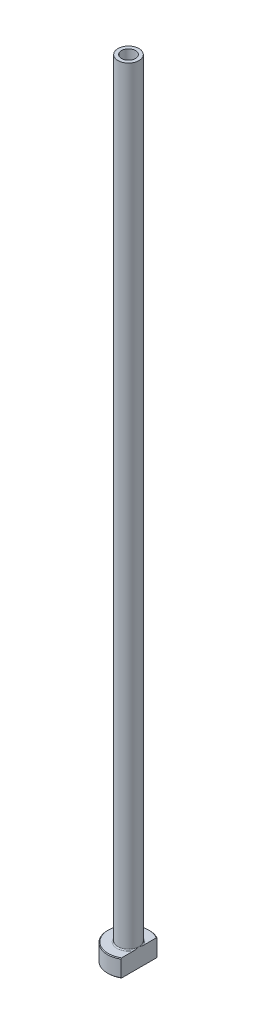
ISO-10303-21;
HEADER;
FILE_DESCRIPTION(('STEP AP214'),'2;1');
FILE_NAME('part.step','',(''),(''),'','','');
FILE_SCHEMA(('AUTOMOTIVE_DESIGN { 1 0 10303 214 1 1 1 1 }'));
ENDSEC;
DATA;
#1=APPLICATION_CONTEXT('core data for automotive mechanical design processes');
#2=APPLICATION_PROTOCOL_DEFINITION('international standard','automotive_design',2000,#1);
#3=PRODUCT_CONTEXT('',#1,'mechanical');
#4=PRODUCT('Part','Part','',(#3));
#5=PRODUCT_RELATED_PRODUCT_CATEGORY('part','',(#4));
#6=PRODUCT_DEFINITION_FORMATION('','',#4);
#7=PRODUCT_DEFINITION_CONTEXT('part definition',#1,'design');
#8=PRODUCT_DEFINITION('design','',#6,#7);
#9=PRODUCT_DEFINITION_SHAPE('','',#8);
#10=(LENGTH_UNIT() NAMED_UNIT(*) SI_UNIT(.MILLI.,.METRE.));
#11=(NAMED_UNIT(*) PLANE_ANGLE_UNIT() SI_UNIT($,.RADIAN.));
#12=(NAMED_UNIT(*) SI_UNIT($,.STERADIAN.) SOLID_ANGLE_UNIT());
#13=UNCERTAINTY_MEASURE_WITH_UNIT(LENGTH_MEASURE(1.E-05),#10,'distance_accuracy_value','');
#14=(GEOMETRIC_REPRESENTATION_CONTEXT(3) GLOBAL_UNCERTAINTY_ASSIGNED_CONTEXT((#13)) GLOBAL_UNIT_ASSIGNED_CONTEXT((#10,
#11,#12)) REPRESENTATION_CONTEXT('',''));
#15=CARTESIAN_POINT('',(0.,0.,0.));
#16=DIRECTION('',(0.,0.,1.));
#17=DIRECTION('',(1.,0.,0.));
#18=AXIS2_PLACEMENT_3D('',#15,#16,#17);
#19=CARTESIAN_POINT('',(0.,92.1876809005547,0.));
#20=DIRECTION('',(0.,1.,0.));
#21=DIRECTION('',(0.,0.,1.));
#22=AXIS2_PLACEMENT_3D('',#19,#20,#21);
#23=CYLINDRICAL_SURFACE('',#22,2.00000000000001);
#24=CARTESIAN_POINT('',(0.,225.,0.));
#25=DIRECTION('',(0.,1.,0.));
#26=DIRECTION('',(0.,0.,1.));
#27=AXIS2_PLACEMENT_3D('',#24,#25,#26);
#28=CIRCLE('',#27,2.00000000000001);
#29=CARTESIAN_POINT('',(0.,225.,2.00000000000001));
#30=VERTEX_POINT('',#29);
#31=EDGE_CURVE('E167',#30,#30,#28,.T.);
#32=ORIENTED_EDGE('',*,*,#31,.T.);
#33=EDGE_LOOP('',(#32));
#34=FACE_BOUND('',#33,.T.);
#35=CARTESIAN_POINT('',(0.,180.,0.));
#36=DIRECTION('',(0.,1.,0.));
#37=DIRECTION('',(0.,0.,1.));
#38=AXIS2_PLACEMENT_3D('',#35,#36,#37);
#39=CIRCLE('',#38,2.00000000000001);
#40=CARTESIAN_POINT('',(0.,180.,2.00000000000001));
#41=VERTEX_POINT('',#40);
#42=EDGE_CURVE('E170',#41,#41,#39,.T.);
#43=ORIENTED_EDGE('',*,*,#42,.F.);
#44=EDGE_LOOP('',(#43));
#45=FACE_BOUND('',#44,.T.);
#46=ADVANCED_FACE('F32',(#34,#45),#23,.F.);
#47=CARTESIAN_POINT('',(-2.00000000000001,225.,0.));
#48=DIRECTION('',(0.,1.,0.));
#49=DIRECTION('',(0.,0.,1.));
#50=AXIS2_PLACEMENT_3D('',#47,#48,#49);
#51=PLANE('',#50);
#52=CARTESIAN_POINT('',(0.,225.,0.));
#53=DIRECTION('',(0.,1.,0.));
#54=DIRECTION('',(0.,0.,1.));
#55=AXIS2_PLACEMENT_3D('',#52,#53,#54);
#56=CIRCLE('',#55,3.00000000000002);
#57=CARTESIAN_POINT('',(0.,225.,3.00000000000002));
#58=VERTEX_POINT('',#57);
#59=EDGE_CURVE('E174',#58,#58,#56,.T.);
#60=ORIENTED_EDGE('',*,*,#59,.T.);
#61=EDGE_LOOP('',(#60));
#62=FACE_BOUND('',#61,.T.);
#63=ORIENTED_EDGE('',*,*,#31,.F.);
#64=EDGE_LOOP('',(#63));
#65=FACE_BOUND('',#64,.T.);
#66=ADVANCED_FACE('F157',(#62,#65),#51,.T.);
#67=CARTESIAN_POINT('',(0.,92.1876809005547,0.));
#68=DIRECTION('',(0.,1.,0.));
#69=DIRECTION('',(0.,0.,1.));
#70=AXIS2_PLACEMENT_3D('',#67,#68,#69);
#71=CYLINDRICAL_SURFACE('',#70,3.);
#72=CARTESIAN_POINT('',(0.,5.3,0.));
#73=DIRECTION('',(0.,1.,0.));
#74=DIRECTION('',(0.,0.,1.));
#75=AXIS2_PLACEMENT_3D('',#72,#73,#74);
#76=CIRCLE('',#75,3.);
#77=CARTESIAN_POINT('',(3.,5.3,0.));
#78=VERTEX_POINT('',#77);
#79=EDGE_CURVE('E180',#78,#78,#76,.T.);
#80=ORIENTED_EDGE('',*,*,#79,.T.);
#81=EDGE_LOOP('',(#80));
#82=FACE_BOUND('',#81,.T.);
#83=ORIENTED_EDGE('',*,*,#59,.F.);
#84=EDGE_LOOP('',(#83));
#85=FACE_BOUND('',#84,.T.);
#86=ADVANCED_FACE('F162',(#82,#85),#71,.T.);
#87=CARTESIAN_POINT('',(-2.99999999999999,5.,0.));
#88=DIRECTION('',(0.,1.,0.));
#89=DIRECTION('',(0.,0.,1.));
#90=AXIS2_PLACEMENT_3D('',#87,#88,#89);
#91=PLANE('',#90);
#92=DIRECTION('',(0.,0.,1.));
#93=VECTOR('',#92,1.);
#94=CARTESIAN_POINT('',(2.99999999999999,5.,0.));
#95=LINE('',#94,#93);
#96=CARTESIAN_POINT('',(3.,5.,-4.96386945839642));
#97=VERTEX_POINT('',#96);
#98=CARTESIAN_POINT('',(2.99999999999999,5.,-1.37477270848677));
#99=VERTEX_POINT('',#98);
#100=EDGE_CURVE('E54',#97,#99,#95,.T.);
#101=ORIENTED_EDGE('',*,*,#100,.F.);
#102=CARTESIAN_POINT('',(0.,5.,0.));
#103=DIRECTION('',(0.,1.,0.));
#104=DIRECTION('',(0.,0.,1.));
#105=AXIS2_PLACEMENT_3D('',#102,#103,#104);
#106=CIRCLE('',#105,5.80000000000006);
#107=CARTESIAN_POINT('',(2.99999999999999,5.,4.96386945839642));
#108=VERTEX_POINT('',#107);
#109=EDGE_CURVE('E186',#97,#108,#106,.T.);
#110=ORIENTED_EDGE('',*,*,#109,.T.);
#111=CARTESIAN_POINT('',(2.99999999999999,5.,1.37477270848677));
#112=VERTEX_POINT('',#111);
#113=EDGE_CURVE('E134',#112,#108,#95,.T.);
#114=ORIENTED_EDGE('',*,*,#113,.F.);
#115=CARTESIAN_POINT('',(0.,5.,0.));
#116=DIRECTION('',(0.,1.,0.));
#117=DIRECTION('',(0.,0.,1.));
#118=AXIS2_PLACEMENT_3D('',#115,#116,#117);
#119=CIRCLE('',#118,3.3);
#120=EDGE_CURVE('E183',#112,#99,#119,.F.);
#121=ORIENTED_EDGE('',*,*,#120,.T.);
#122=EDGE_LOOP('',(#101,#110,#114,#121));
#123=FACE_BOUND('',#122,.T.);
#124=ADVANCED_FACE('F197',(#123),#91,.T.);
#125=CARTESIAN_POINT('',(0.,92.1876809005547,0.));
#126=DIRECTION('',(0.,1.,0.));
#127=DIRECTION('',(0.,0.,1.));
#128=AXIS2_PLACEMENT_3D('',#125,#126,#127);
#129=CYLINDRICAL_SURFACE('',#128,5.99999999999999);
#130=DIRECTION('',(0.,-1.,0.));
#131=VECTOR('',#130,1.);
#132=CARTESIAN_POINT('',(2.99999999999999,225.,5.19615242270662));
#133=LINE('',#132,#131);
#134=CARTESIAN_POINT('',(2.99999999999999,4.80000000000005,5.19615242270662));
#135=VERTEX_POINT('',#134);
#136=CARTESIAN_POINT('',(2.99999999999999,0.199999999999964,5.19615242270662));
#137=VERTEX_POINT('',#136);
#138=EDGE_CURVE('E82',#135,#137,#133,.T.);
#139=ORIENTED_EDGE('',*,*,#138,.F.);
#140=CARTESIAN_POINT('',(0.,4.80000000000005,0.));
#141=DIRECTION('',(0.,1.,0.));
#142=DIRECTION('',(0.,0.,1.));
#143=AXIS2_PLACEMENT_3D('',#140,#141,#142);
#144=CIRCLE('',#143,5.99999999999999);
#145=CARTESIAN_POINT('',(3.,4.80000000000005,-5.19615242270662));
#146=VERTEX_POINT('',#145);
#147=EDGE_CURVE('E95',#135,#146,#144,.F.);
#148=ORIENTED_EDGE('',*,*,#147,.T.);
#149=DIRECTION('',(0.,-1.,0.));
#150=VECTOR('',#149,1.);
#151=CARTESIAN_POINT('',(3.,225.,-5.19615242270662));
#152=LINE('',#151,#150);
#153=CARTESIAN_POINT('',(3.,0.199999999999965,-5.19615242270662));
#154=VERTEX_POINT('',#153);
#155=EDGE_CURVE('E192',#146,#154,#152,.T.);
#156=ORIENTED_EDGE('',*,*,#155,.T.);
#157=CARTESIAN_POINT('',(0.,0.199999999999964,0.));
#158=DIRECTION('',(0.,-1.,0.));
#159=DIRECTION('',(0.,0.,-1.));
#160=AXIS2_PLACEMENT_3D('',#157,#158,#159);
#161=CIRCLE('',#160,5.99999999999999);
#162=EDGE_CURVE('E98',#154,#137,#161,.F.);
#163=ORIENTED_EDGE('',*,*,#162,.T.);
#164=EDGE_LOOP('',(#139,#148,#156,#163));
#165=FACE_BOUND('',#164,.T.);
#166=ADVANCED_FACE('F190',(#165),#129,.T.);
#167=CARTESIAN_POINT('',(-5.99999999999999,0.,0.));
#168=DIRECTION('',(0.,-1.,0.));
#169=DIRECTION('',(0.,0.,-1.));
#170=AXIS2_PLACEMENT_3D('',#167,#168,#169);
#171=PLANE('',#170);
#172=CARTESIAN_POINT('',(0.,0.,0.));
#173=DIRECTION('',(0.,-1.,0.));
#174=DIRECTION('',(0.,0.,-1.));
#175=AXIS2_PLACEMENT_3D('',#172,#173,#174);
#176=CIRCLE('',#175,2.74999999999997);
#177=CARTESIAN_POINT('',(0.,0.,-2.74999999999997));
#178=VERTEX_POINT('',#177);
#179=EDGE_CURVE('E40',#178,#178,#176,.F.);
#180=ORIENTED_EDGE('',*,*,#179,.T.);
#181=EDGE_LOOP('',(#180));
#182=FACE_BOUND('',#181,.T.);
#183=DIRECTION('',(0.,0.,-1.));
#184=VECTOR('',#183,1.);
#185=CARTESIAN_POINT('',(2.99999999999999,0.,5.19615242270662));
#186=LINE('',#185,#184);
#187=CARTESIAN_POINT('',(2.99999999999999,0.,4.96386945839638));
#188=VERTEX_POINT('',#187);
#189=CARTESIAN_POINT('',(3.,0.,-4.96386945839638));
#190=VERTEX_POINT('',#189);
#191=EDGE_CURVE('E47',#188,#190,#186,.T.);
#192=ORIENTED_EDGE('',*,*,#191,.F.);
#193=CARTESIAN_POINT('',(0.,0.,0.));
#194=DIRECTION('',(0.,-1.,0.));
#195=DIRECTION('',(0.,0.,-1.));
#196=AXIS2_PLACEMENT_3D('',#193,#194,#195);
#197=CIRCLE('',#196,5.80000000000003);
#198=EDGE_CURVE('E92',#188,#190,#197,.T.);
#199=ORIENTED_EDGE('',*,*,#198,.T.);
#200=EDGE_LOOP('',(#192,#199));
#201=FACE_BOUND('',#200,.T.);
#202=ADVANCED_FACE('F91',(#182,#201),#171,.T.);
#203=CARTESIAN_POINT('',(0.,92.1876809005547,0.));
#204=DIRECTION('',(0.,1.,0.));
#205=DIRECTION('',(0.,0.,1.));
#206=AXIS2_PLACEMENT_3D('',#203,#204,#205);
#207=CYLINDRICAL_SURFACE('',#206,2.25);
#208=CARTESIAN_POINT('',(0.,0.5,0.));
#209=DIRECTION('',(0.,-1.,0.));
#210=DIRECTION('',(0.,0.,-1.));
#211=AXIS2_PLACEMENT_3D('',#208,#209,#210);
#212=CIRCLE('',#211,2.25);
#213=CARTESIAN_POINT('',(0.,0.5,-2.25));
#214=VERTEX_POINT('',#213);
#215=EDGE_CURVE('E11',#214,#214,#212,.T.);
#216=ORIENTED_EDGE('',*,*,#215,.T.);
#217=EDGE_LOOP('',(#216));
#218=FACE_BOUND('',#217,.T.);
#219=CARTESIAN_POINT('',(0.,168.,0.));
#220=DIRECTION('',(0.,1.,0.));
#221=DIRECTION('',(0.,0.,1.));
#222=AXIS2_PLACEMENT_3D('',#219,#220,#221);
#223=CIRCLE('',#222,2.25000000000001);
#224=CARTESIAN_POINT('',(0.,168.,2.25000000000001));
#225=VERTEX_POINT('',#224);
#226=EDGE_CURVE('E172',#225,#225,#223,.T.);
#227=ORIENTED_EDGE('',*,*,#226,.T.);
#228=EDGE_LOOP('',(#227));
#229=FACE_BOUND('',#228,.T.);
#230=ADVANCED_FACE('F215',(#218,#229),#207,.F.);
#231=CARTESIAN_POINT('',(0.,168.,0.));
#232=DIRECTION('',(0.,-1.,0.));
#233=DIRECTION('',(0.,0.,-1.));
#234=AXIS2_PLACEMENT_3D('',#231,#232,#233);
#235=CONICAL_SURFACE('',#234,2.25000000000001,0.0208303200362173);
#236=ORIENTED_EDGE('',*,*,#42,.T.);
#237=EDGE_LOOP('',(#236));
#238=FACE_BOUND('',#237,.T.);
#239=ORIENTED_EDGE('',*,*,#226,.F.);
#240=EDGE_LOOP('',(#239));
#241=FACE_BOUND('',#240,.T.);
#242=ADVANCED_FACE('F111',(#238,#241),#235,.F.);
#243=CARTESIAN_POINT('',(0.,5.3,0.));
#244=DIRECTION('',(0.,1.,0.));
#245=DIRECTION('',(0.,0.,1.));
#246=AXIS2_PLACEMENT_3D('',#243,#244,#245);
#247=TOROIDAL_SURFACE('',#246,3.3,0.3);
#248=ORIENTED_EDGE('',*,*,#120,.F.);
#249=CARTESIAN_POINT('',(3.,5.3,0.));
#250=CARTESIAN_POINT('',(3.,5.3000006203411,-1.12611076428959E-10));
#251=CARTESIAN_POINT('',(3.,5.30000124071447,1.79706863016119E-07));
#252=CARTESIAN_POINT('',(3.,5.30000241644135,7.12597681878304E-07));
#253=CARTESIAN_POINT('',(3.,5.30000296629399,1.07470925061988E-06));
#254=CARTESIAN_POINT('',(3.,5.30000408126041,1.93940847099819E-06));
#255=CARTESIAN_POINT('',(3.,5.3000046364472,2.45488642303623E-06));
#256=CARTESIAN_POINT('',(3.,5.30000565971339,3.54465580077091E-06));
#257=CARTESIAN_POINT('',(3.,5.30000612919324,4.11770724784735E-06));
#258=CARTESIAN_POINT('',(3.,5.30000778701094,6.25396528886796E-06));
#259=CARTESIAN_POINT('',(3.,5.30000888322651,7.89070948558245E-06));
#260=CARTESIAN_POINT('',(3.,5.3000107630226,1.11998064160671E-05));
#261=CARTESIAN_POINT('',(3.,5.30001156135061,1.28642122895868E-05));
#262=CARTESIAN_POINT('',(3.,5.30001474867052,1.96537189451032E-05));
#263=CARTESIAN_POINT('',(3.,5.30001702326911,2.48380262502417E-05));
#264=CARTESIAN_POINT('',(3.,5.30002052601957,3.48178510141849E-05));
#265=CARTESIAN_POINT('',(3.,5.30002184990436,3.95800651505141E-05));
#266=CARTESIAN_POINT('',(3.,5.30003122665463,7.41814419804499E-05));
#267=CARTESIAN_POINT('',(3.,5.30003808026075,0.000104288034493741));
#268=CARTESIAN_POINT('',(2.99999999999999,5.30006804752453,0.000222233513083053));
#269=CARTESIAN_POINT('',(2.99999999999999,5.30009687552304,0.000308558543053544));
#270=CARTESIAN_POINT('',(3.,5.30020809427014,0.000648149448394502));
#271=CARTESIAN_POINT('',(3.,5.30028657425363,0.000902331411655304));
#272=CARTESIAN_POINT('',(2.99999999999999,5.30059876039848,0.00190491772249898));
#273=CARTESIAN_POINT('',(2.99999999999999,5.30083723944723,0.00265218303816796));
#274=CARTESIAN_POINT('',(3.,5.30182192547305,0.00574694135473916));
#275=CARTESIAN_POINT('',(3.,5.3025622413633,0.00809584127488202));
#276=CARTESIAN_POINT('',(2.99999999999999,5.31160267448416,0.0367678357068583));
#277=CARTESIAN_POINT('',(2.99999999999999,5.31993817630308,0.0630827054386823));
#278=CARTESIAN_POINT('',(3.,5.33621504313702,0.114704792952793));
#279=CARTESIAN_POINT('',(3.,5.34415908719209,0.140011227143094));
#280=CARTESIAN_POINT('',(2.99999999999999,5.36094382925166,0.193774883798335));
#281=CARTESIAN_POINT('',(3.,5.3697741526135,0.222235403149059));
#282=CARTESIAN_POINT('',(3.,5.38736474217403,0.279512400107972));
#283=CARTESIAN_POINT('',(3.,5.396123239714,0.308329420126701));
#284=CARTESIAN_POINT('',(3.,5.41726575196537,0.378880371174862));
#285=CARTESIAN_POINT('',(3.,5.4295272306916,0.420651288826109));
#286=CARTESIAN_POINT('',(3.,5.45309597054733,0.503357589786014));
#287=CARTESIAN_POINT('',(3.,5.46441924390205,0.544288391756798));
#288=CARTESIAN_POINT('',(3.,5.48778169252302,0.632156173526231));
#289=CARTESIAN_POINT('',(3.,5.49969678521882,0.67912648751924));
#290=CARTESIAN_POINT('',(3.,5.52221484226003,0.773740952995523));
#291=CARTESIAN_POINT('',(3.,5.53280772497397,0.82138752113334));
#292=CARTESIAN_POINT('',(3.,5.55291503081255,0.920589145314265));
#293=CARTESIAN_POINT('',(3.,5.56229188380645,0.972172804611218));
#294=CARTESIAN_POINT('',(3.,5.57838694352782,1.0757483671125));
#295=CARTESIAN_POINT('',(3.,5.585105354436,1.12774023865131));
#296=CARTESIAN_POINT('',(3.,5.59681427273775,1.24924411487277));
#297=CARTESIAN_POINT('',(3.,5.60051317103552,1.31890364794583));
#298=CARTESIAN_POINT('',(3.,5.59966579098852,1.42270835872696));
#299=CARTESIAN_POINT('',(3.,5.59835823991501,1.45688093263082));
#300=CARTESIAN_POINT('',(3.,5.59322745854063,1.52502533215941));
#301=CARTESIAN_POINT('',(3.,5.58940645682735,1.55899730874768));
#302=CARTESIAN_POINT('',(3.,5.57976146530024,1.6194781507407));
#303=CARTESIAN_POINT('',(3.,5.57451506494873,1.64607760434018));
#304=CARTESIAN_POINT('',(3.,5.56161153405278,1.69883648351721));
#305=CARTESIAN_POINT('',(3.,5.55394338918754,1.7249933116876));
#306=CARTESIAN_POINT('',(3.,5.53555176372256,1.77650913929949));
#307=CARTESIAN_POINT('',(3.,5.52480031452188,1.80185836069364));
#308=CARTESIAN_POINT('',(3.,5.49948027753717,1.85054545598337));
#309=CARTESIAN_POINT('',(3.,5.48493141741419,1.87389291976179));
#310=CARTESIAN_POINT('',(3.,5.45992470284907,1.90552135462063));
#311=CARTESIAN_POINT('',(3.,5.45133318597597,1.91527363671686));
#312=CARTESIAN_POINT('',(3.,5.43294163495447,1.93360072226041));
#313=CARTESIAN_POINT('',(3.,5.42314083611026,1.94217477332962));
#314=CARTESIAN_POINT('',(3.,5.40215892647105,1.95778354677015));
#315=CARTESIAN_POINT('',(3.,5.39096156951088,1.96479687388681));
#316=CARTESIAN_POINT('',(3.,5.36742144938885,1.97652218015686));
#317=CARTESIAN_POINT('',(3.,5.35508207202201,1.98124071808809));
#318=CARTESIAN_POINT('',(3.,5.33320117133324,1.98690185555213));
#319=CARTESIAN_POINT('',(3.,5.32383559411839,1.98852953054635));
#320=CARTESIAN_POINT('',(3.,5.30496375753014,1.99016898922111));
#321=CARTESIAN_POINT('',(3.,5.29545756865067,1.99018155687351));
#322=CARTESIAN_POINT('',(3.,5.27659318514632,1.9885897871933));
#323=CARTESIAN_POINT('',(3.,5.26723486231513,1.98698693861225));
#324=CARTESIAN_POINT('',(3.,5.2488995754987,1.9822972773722));
#325=CARTESIAN_POINT('',(3.,5.23992286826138,1.97920948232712));
#326=CARTESIAN_POINT('',(3.,5.21981293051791,1.97059641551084));
#327=CARTESIAN_POINT('',(3.,5.20887713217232,1.96461176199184));
#328=CARTESIAN_POINT('',(3.,5.18811536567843,1.95095727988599));
#329=CARTESIAN_POINT('',(3.,5.17829177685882,1.94328393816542));
#330=CARTESIAN_POINT('',(3.,5.15512177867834,1.92254223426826));
#331=CARTESIAN_POINT('',(3.,5.14247568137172,1.90869680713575));
#332=CARTESIAN_POINT('',(3.,5.1194459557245,1.87927587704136));
#333=CARTESIAN_POINT('',(3.,5.10906527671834,1.86369815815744));
#334=CARTESIAN_POINT('',(3.,5.08309609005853,1.81927355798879));
#335=CARTESIAN_POINT('',(3.,5.06948546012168,1.78928084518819));
#336=CARTESIAN_POINT('',(3.,5.04658664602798,1.72751962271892));
#337=CARTESIAN_POINT('',(3.,5.03733582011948,1.69573828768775));
#338=CARTESIAN_POINT('',(3.,5.0221431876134,1.63079918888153));
#339=CARTESIAN_POINT('',(3.,5.01626537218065,1.59762686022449));
#340=CARTESIAN_POINT('',(3.,5.00734002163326,1.53086029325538));
#341=CARTESIAN_POINT('',(3.,5.00429797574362,1.49726536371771));
#342=CARTESIAN_POINT('',(3.,5.00059037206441,1.43100872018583));
#343=CARTESIAN_POINT('',(3.,4.99985343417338,1.39835069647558));
#344=CARTESIAN_POINT('',(3.,5.00019322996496,1.33318312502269));
#345=CARTESIAN_POINT('',(3.,5.00126261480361,1.30067351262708));
#346=CARTESIAN_POINT('',(3.,5.00569854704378,1.22190465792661));
#347=CARTESIAN_POINT('',(3.,5.00984986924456,1.17569031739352));
#348=CARTESIAN_POINT('',(3.,5.02060876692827,1.08357061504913));
#349=CARTESIAN_POINT('',(3.,5.02721586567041,1.03766519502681));
#350=CARTESIAN_POINT('',(3.,5.04258096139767,0.945130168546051));
#351=CARTESIAN_POINT('',(3.,5.05138514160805,0.898508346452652));
#352=CARTESIAN_POINT('',(3.,5.07066869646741,0.805496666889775));
#353=CARTESIAN_POINT('',(3.,5.08115218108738,0.759107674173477));
#354=CARTESIAN_POINT('',(3.,5.10738921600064,0.650207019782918));
#355=CARTESIAN_POINT('',(3.,5.12369110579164,0.587828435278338));
#356=CARTESIAN_POINT('',(3.,5.15777680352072,0.46421277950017));
#357=CARTESIAN_POINT('',(3.,5.17554263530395,0.402970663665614));
#358=CARTESIAN_POINT('',(3.,5.2100672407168,0.287596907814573));
#359=CARTESIAN_POINT('',(3.,5.22671796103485,0.233432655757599));
#360=CARTESIAN_POINT('',(3.,5.25241226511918,0.150940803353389));
#361=CARTESIAN_POINT('',(3.,5.2613106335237,0.122567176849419));
#362=CARTESIAN_POINT('',(3.,5.27905176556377,0.0662804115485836));
#363=CARTESIAN_POINT('',(2.99999999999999,5.28789327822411,0.0383669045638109));
#364=CARTESIAN_POINT('',(3.,5.29743877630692,0.00809257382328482));
#365=CARTESIAN_POINT('',(3.,5.29818012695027,0.00574041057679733));
#366=CARTESIAN_POINT('',(3.,5.29916506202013,0.00264489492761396));
#367=CARTESIAN_POINT('',(3.,5.29940274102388,0.00190013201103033));
#368=CARTESIAN_POINT('',(3.,5.29971394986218,0.000900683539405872));
#369=CARTESIAN_POINT('',(3.,5.29979223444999,0.00064713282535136));
#370=CARTESIAN_POINT('',(3.,5.29990321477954,0.000308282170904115));
#371=CARTESIAN_POINT('',(3.,5.29993200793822,0.000222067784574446));
#372=CARTESIAN_POINT('',(3.,5.29996194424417,0.000104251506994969));
#373=CARTESIAN_POINT('',(3.,5.29996879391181,7.41614257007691E-05));
#374=CARTESIAN_POINT('',(3.,5.29997816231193,3.95766714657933E-05));
#375=CARTESIAN_POINT('',(3.,5.29997948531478,3.48154674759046E-05));
#376=CARTESIAN_POINT('',(3.,5.29998298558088,2.48376286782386E-05));
#377=CARTESIAN_POINT('',(3.,5.29998525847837,1.96542458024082E-05));
#378=CARTESIAN_POINT('',(3.,5.29998844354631,1.28656657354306E-05));
#379=CARTESIAN_POINT('',(3.,5.29998924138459,1.1201335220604E-05));
#380=CARTESIAN_POINT('',(3.,5.29999112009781,7.89230050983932E-06));
#381=CARTESIAN_POINT('',(3.,5.29999221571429,6.25553551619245E-06));
#382=CARTESIAN_POINT('',(3.,5.29999387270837,4.11914378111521E-06));
#383=CARTESIAN_POINT('',(3.,5.29999434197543,3.54603105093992E-06));
#384=CARTESIAN_POINT('',(3.,5.29999536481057,2.45610077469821E-06));
#385=CARTESIAN_POINT('',(3.,5.29999591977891,1.94052235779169E-06));
#386=CARTESIAN_POINT('',(3.,5.29999703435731,1.07558328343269E-06));
#387=CARTESIAN_POINT('',(3.,5.29999758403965,7.13339485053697E-07));
#388=CARTESIAN_POINT('',(3.,5.29999875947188,1.80121956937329E-07));
#389=CARTESIAN_POINT('',(3.,5.2999993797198,1.12600521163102E-10));
#390=CARTESIAN_POINT('',(3.,5.3,0.));
#391=B_SPLINE_CURVE_WITH_KNOTS('',3,(#249,#250,#251,#252,#253,#254,#255,#256,#257,#258,#259,
#260,#261,#262,#263,#264,#265,#266,#267,#268,#269,#270,#271,#272,#273,#274,#275,#276,#277,#278,
#279,#280,#281,#282,#283,#284,#285,#286,#287,#288,#289,#290,#291,#292,#293,#294,#295,#296,#297,
#298,#299,#300,#301,#302,#303,#304,#305,#306,#307,#308,#309,#310,#311,#312,#313,#314,#315,#316,
#317,#318,#319,#320,#321,#322,#323,#324,#325,#326,#327,#328,#329,#330,#331,#332,#333,#334,#335,
#336,#337,#338,#339,#340,#341,#342,#343,#344,#345,#346,#347,#348,#349,#350,#351,#352,#353,#354,
#355,#356,#357,#358,#359,#360,#361,#362,#363,#364,#365,#366,#367,#368,#369,#370,#371,#372,#373,
#374,#375,#376,#377,#378,#379,#380,#381,#382,#383,#384,#385,#386,#387,#388,#389,#390),
.UNSPECIFIED.,.T.,.F.,(4,2,2,2,2,2,2,2,2,2,2,2,2,2,2,2,2,2,2,2,2,2,2,2,2,2,2,2,2,2,2,2,2,2,2,2,
2,2,2,2,2,2,2,2,2,2,2,2,2,2,2,2,2,2,2,2,2,2,2,2,2,2,2,2,2,2,2,2,2,2,4),(0.,1.86513812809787E-06,
3.83353150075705E-06,6.09513108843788E-06,8.31560377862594E-06,1.42000679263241E-05,
1.9733547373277E-05,3.66769838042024E-05,5.14858282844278E-05,0.000144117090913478,
0.000416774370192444,0.00121521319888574,0.00356794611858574,0.0109568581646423,
0.093763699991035,0.173336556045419,0.262732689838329,0.353088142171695,0.48368402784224,
0.611082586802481,0.756439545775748,0.902844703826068,1.06007042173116,1.21728406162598,
1.42611662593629,1.52864191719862,1.63107642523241,1.71232857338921,1.7939557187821,
1.87634808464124,1.95832065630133,1.99722769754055,2.03615946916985,2.07559591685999,
2.11491897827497,2.14330913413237,2.17168550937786,2.20003575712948,2.22840478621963,
2.26559554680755,2.30286442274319,2.35880214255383,2.41481225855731,2.51307007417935,
2.61215518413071,2.71306273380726,2.81416520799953,2.91210427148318,3.00964583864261,
3.14875779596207,3.28784276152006,3.43014232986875,3.57279564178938,3.76617940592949,
3.9574672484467,4.12746077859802,4.21667041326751,4.30450746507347,4.31190664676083,
4.31425150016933,4.31504795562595,4.31532026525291,4.3154128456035,4.3154276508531,
4.31544458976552,4.31545012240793,4.31545600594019,4.31545822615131,4.31546048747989,
4.31546245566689,4.3154643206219),.UNSPECIFIED.);
#392=EDGE_CURVE('E126',#112,#78,#391,.T.);
#393=ORIENTED_EDGE('',*,*,#392,.T.);
#394=ORIENTED_EDGE('',*,*,#79,.F.);
#395=CARTESIAN_POINT('',(3.,5.3,0.));
#396=CARTESIAN_POINT('',(3.,5.2999993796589,1.12611568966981E-10));
#397=CARTESIAN_POINT('',(3.,5.29999875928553,-1.79706862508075E-07));
#398=CARTESIAN_POINT('',(3.,5.29999758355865,-7.12597681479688E-07));
#399=CARTESIAN_POINT('',(3.,5.29999703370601,-1.07470925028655E-06));
#400=CARTESIAN_POINT('',(3.,5.29999591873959,-1.93940847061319E-06));
#401=CARTESIAN_POINT('',(3.,5.2999953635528,-2.45488642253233E-06));
#402=CARTESIAN_POINT('',(3.,5.29999434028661,-3.54465580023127E-06));
#403=CARTESIAN_POINT('',(3.,5.29999387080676,-4.11770724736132E-06));
#404=CARTESIAN_POINT('',(3.,5.29999221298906,-6.25396528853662E-06));
#405=CARTESIAN_POINT('',(3.,5.29999111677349,-7.8907094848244E-06));
#406=CARTESIAN_POINT('',(3.,5.29998923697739,-1.11998064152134E-05));
#407=CARTESIAN_POINT('',(3.,5.29998843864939,-1.28642122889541E-05));
#408=CARTESIAN_POINT('',(3.,5.29998525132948,-1.9653718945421E-05));
#409=CARTESIAN_POINT('',(3.,5.29998297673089,-2.48380262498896E-05));
#410=CARTESIAN_POINT('',(3.,5.29997947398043,-3.48178510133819E-05));
#411=CARTESIAN_POINT('',(3.,5.29997815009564,-3.95800651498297E-05));
#412=CARTESIAN_POINT('',(3.,5.29996877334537,-7.41814419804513E-05));
#413=CARTESIAN_POINT('',(3.,5.29996191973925,-0.000104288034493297));
#414=CARTESIAN_POINT('',(3.,5.29993195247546,-0.000222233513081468));
#415=CARTESIAN_POINT('',(3.,5.29990312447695,-0.000308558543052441));
#416=CARTESIAN_POINT('',(3.,5.29979190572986,-0.000648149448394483));
#417=CARTESIAN_POINT('',(3.,5.29971342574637,-0.00090233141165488));
#418=CARTESIAN_POINT('',(3.,5.29940123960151,-0.00190491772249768));
#419=CARTESIAN_POINT('',(3.,5.29916276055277,-0.00265218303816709));
#420=CARTESIAN_POINT('',(3.,5.29817807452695,-0.00574694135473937));
#421=CARTESIAN_POINT('',(3.,5.2974377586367,-0.00809584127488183));
#422=CARTESIAN_POINT('',(2.99999999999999,5.28839732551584,-0.0367678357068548));
#423=CARTESIAN_POINT('',(3.,5.28006182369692,-0.0630827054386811));
#424=CARTESIAN_POINT('',(3.,5.26378495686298,-0.114704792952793));
#425=CARTESIAN_POINT('',(3.,5.2558409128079,-0.140011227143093));
#426=CARTESIAN_POINT('',(3.,5.23905617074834,-0.193774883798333));
#427=CARTESIAN_POINT('',(3.,5.2302258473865,-0.222235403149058));
#428=CARTESIAN_POINT('',(3.,5.21263525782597,-0.27951240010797));
#429=CARTESIAN_POINT('',(3.,5.203876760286,-0.308329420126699));
#430=CARTESIAN_POINT('',(3.,5.18273424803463,-0.378880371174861));
#431=CARTESIAN_POINT('',(3.,5.17047276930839,-0.420651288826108));
#432=CARTESIAN_POINT('',(3.,5.14690402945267,-0.503357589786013));
#433=CARTESIAN_POINT('',(3.,5.13558075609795,-0.544288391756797));
#434=CARTESIAN_POINT('',(3.,5.11221830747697,-0.63215617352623));
#435=CARTESIAN_POINT('',(3.,5.10030321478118,-0.67912648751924));
#436=CARTESIAN_POINT('',(3.,5.07778515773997,-0.773740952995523));
#437=CARTESIAN_POINT('',(3.,5.06719227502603,-0.82138752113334));
#438=CARTESIAN_POINT('',(3.,5.04708496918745,-0.920589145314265));
#439=CARTESIAN_POINT('',(3.,5.03770811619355,-0.972172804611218));
#440=CARTESIAN_POINT('',(3.,5.02161305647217,-1.0757483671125));
#441=CARTESIAN_POINT('',(3.,5.014894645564,-1.12774023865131));
#442=CARTESIAN_POINT('',(3.,5.00318572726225,-1.24924411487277));
#443=CARTESIAN_POINT('',(3.,4.99948682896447,-1.31890364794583));
#444=CARTESIAN_POINT('',(3.,5.00033420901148,-1.42270835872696));
#445=CARTESIAN_POINT('',(3.,5.00164176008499,-1.45688093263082));
#446=CARTESIAN_POINT('',(3.,5.00677254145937,-1.52502533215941));
#447=CARTESIAN_POINT('',(3.,5.01059354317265,-1.55899730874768));
#448=CARTESIAN_POINT('',(3.,5.02023853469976,-1.6194781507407));
#449=CARTESIAN_POINT('',(3.,5.02548493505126,-1.64607760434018));
#450=CARTESIAN_POINT('',(3.,5.03838846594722,-1.69883648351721));
#451=CARTESIAN_POINT('',(3.,5.04605661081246,-1.72499331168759));
#452=CARTESIAN_POINT('',(3.,5.06444823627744,-1.77650913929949));
#453=CARTESIAN_POINT('',(3.,5.07519968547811,-1.80185836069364));
#454=CARTESIAN_POINT('',(3.,5.10051972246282,-1.85054545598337));
#455=CARTESIAN_POINT('',(3.,5.11506858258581,-1.87389291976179));
#456=CARTESIAN_POINT('',(3.,5.14007529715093,-1.90552135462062));
#457=CARTESIAN_POINT('',(3.,5.14866681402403,-1.91527363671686));
#458=CARTESIAN_POINT('',(3.,5.16705836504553,-1.93360072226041));
#459=CARTESIAN_POINT('',(3.,5.17685916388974,-1.94217477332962));
#460=CARTESIAN_POINT('',(3.,5.19784107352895,-1.95778354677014));
#461=CARTESIAN_POINT('',(3.,5.20903843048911,-1.96479687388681));
#462=CARTESIAN_POINT('',(3.,5.23257855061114,-1.97652218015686));
#463=CARTESIAN_POINT('',(3.,5.24491792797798,-1.98124071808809));
#464=CARTESIAN_POINT('',(3.,5.26679882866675,-1.98690185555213));
#465=CARTESIAN_POINT('',(3.,5.27616440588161,-1.98852953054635));
#466=CARTESIAN_POINT('',(3.,5.29503624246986,-1.99016898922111));
#467=CARTESIAN_POINT('',(3.,5.30454243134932,-1.99018155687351));
#468=CARTESIAN_POINT('',(3.,5.32340681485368,-1.9885897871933));
#469=CARTESIAN_POINT('',(3.,5.33276513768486,-1.98698693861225));
#470=CARTESIAN_POINT('',(3.,5.3511004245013,-1.9822972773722));
#471=CARTESIAN_POINT('',(3.,5.36007713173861,-1.97920948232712));
#472=CARTESIAN_POINT('',(3.,5.38018706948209,-1.97059641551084));
#473=CARTESIAN_POINT('',(3.,5.39112286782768,-1.96461176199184));
#474=CARTESIAN_POINT('',(3.,5.41188463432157,-1.95095727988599));
#475=CARTESIAN_POINT('',(3.,5.42170822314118,-1.94328393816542));
#476=CARTESIAN_POINT('',(3.,5.44487822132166,-1.92254223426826));
#477=CARTESIAN_POINT('',(3.,5.45752431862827,-1.90869680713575));
#478=CARTESIAN_POINT('',(3.,5.4805540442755,-1.87927587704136));
#479=CARTESIAN_POINT('',(3.,5.49093472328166,-1.86369815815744));
#480=CARTESIAN_POINT('',(3.,5.51690390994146,-1.81927355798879));
#481=CARTESIAN_POINT('',(3.,5.53051453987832,-1.78928084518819));
#482=CARTESIAN_POINT('',(3.,5.55341335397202,-1.72751962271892));
#483=CARTESIAN_POINT('',(3.,5.56266417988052,-1.69573828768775));
#484=CARTESIAN_POINT('',(3.,5.5778568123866,-1.63079918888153));
#485=CARTESIAN_POINT('',(3.,5.58373462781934,-1.5976268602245));
#486=CARTESIAN_POINT('',(3.,5.59265997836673,-1.53086029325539));
#487=CARTESIAN_POINT('',(3.,5.59570202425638,-1.49726536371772));
#488=CARTESIAN_POINT('',(3.,5.59940962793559,-1.43100872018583));
#489=CARTESIAN_POINT('',(3.,5.60014656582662,-1.39835069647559));
#490=CARTESIAN_POINT('',(3.,5.59980677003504,-1.3331831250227));
#491=CARTESIAN_POINT('',(3.,5.59873738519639,-1.30067351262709));
#492=CARTESIAN_POINT('',(3.,5.59430145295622,-1.22190465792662));
#493=CARTESIAN_POINT('',(3.,5.59015013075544,-1.17569031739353));
#494=CARTESIAN_POINT('',(3.,5.57939123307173,-1.08357061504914));
#495=CARTESIAN_POINT('',(3.,5.57278413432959,-1.03766519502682));
#496=CARTESIAN_POINT('',(3.,5.55741903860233,-0.945130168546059));
#497=CARTESIAN_POINT('',(3.,5.54861485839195,-0.898508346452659));
#498=CARTESIAN_POINT('',(3.,5.52933130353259,-0.805496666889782));
#499=CARTESIAN_POINT('',(3.,5.51884781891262,-0.759107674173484));
#500=CARTESIAN_POINT('',(3.,5.49261078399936,-0.650207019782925));
#501=CARTESIAN_POINT('',(3.,5.47630889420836,-0.587828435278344));
#502=CARTESIAN_POINT('',(3.,5.44222319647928,-0.464212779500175));
#503=CARTESIAN_POINT('',(3.,5.42445736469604,-0.402970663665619));
#504=CARTESIAN_POINT('',(3.,5.3899327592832,-0.287596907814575));
#505=CARTESIAN_POINT('',(3.,5.37328203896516,-0.2334326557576));
#506=CARTESIAN_POINT('',(3.,5.34758773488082,-0.150940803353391));
#507=CARTESIAN_POINT('',(3.,5.33868936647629,-0.122567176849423));
#508=CARTESIAN_POINT('',(3.,5.32094823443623,-0.066280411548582));
#509=CARTESIAN_POINT('',(2.99999999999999,5.31210672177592,-0.038366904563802));
#510=CARTESIAN_POINT('',(3.,5.30256122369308,-0.00809257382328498));
#511=CARTESIAN_POINT('',(3.,5.30181987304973,-0.00574041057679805));
#512=CARTESIAN_POINT('',(3.,5.30083493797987,-0.00264489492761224));
#513=CARTESIAN_POINT('',(3.,5.30059725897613,-0.00190013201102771));
#514=CARTESIAN_POINT('',(3.,5.30028605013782,-0.000900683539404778));
#515=CARTESIAN_POINT('',(3.,5.30020776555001,-0.000647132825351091));
#516=CARTESIAN_POINT('',(3.,5.30009678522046,-0.000308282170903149));
#517=CARTESIAN_POINT('',(3.,5.30006799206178,-0.000222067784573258));
#518=CARTESIAN_POINT('',(3.,5.30003805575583,-0.000104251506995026));
#519=CARTESIAN_POINT('',(3.,5.30003120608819,-7.4161425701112E-05));
#520=CARTESIAN_POINT('',(3.,5.30002183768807,-3.95766714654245E-05));
#521=CARTESIAN_POINT('',(3.,5.30002051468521,-3.48154674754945E-05));
#522=CARTESIAN_POINT('',(3.,5.30001701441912,-2.48376286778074E-05));
#523=CARTESIAN_POINT('',(3.,5.30001474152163,-1.96542458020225E-05));
#524=CARTESIAN_POINT('',(3.,5.30001155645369,-1.28656657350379E-05));
#525=CARTESIAN_POINT('',(3.,5.30001075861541,-1.12013352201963E-05));
#526=CARTESIAN_POINT('',(3.,5.30000887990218,-7.89230050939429E-06));
#527=CARTESIAN_POINT('',(3.,5.3000077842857,-6.25553551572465E-06));
#528=CARTESIAN_POINT('',(3.,5.30000612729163,-4.11914378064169E-06));
#529=CARTESIAN_POINT('',(3.,5.30000565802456,-3.5460310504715E-06));
#530=CARTESIAN_POINT('',(3.,5.30000463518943,-2.45610077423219E-06));
#531=CARTESIAN_POINT('',(3.,5.30000408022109,-1.94052235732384E-06));
#532=CARTESIAN_POINT('',(3.,5.30000296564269,-1.07558328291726E-06));
#533=CARTESIAN_POINT('',(3.,5.30000241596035,-7.13339484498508E-07));
#534=CARTESIAN_POINT('',(3.,5.30000124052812,-1.80121956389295E-07));
#535=CARTESIAN_POINT('',(3.,5.30000062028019,-1.12600012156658E-10));
#536=CARTESIAN_POINT('',(3.,5.3,0.));
#537=B_SPLINE_CURVE_WITH_KNOTS('',3,(#395,#396,#397,#398,#399,#400,#401,#402,#403,#404,#405,
#406,#407,#408,#409,#410,#411,#412,#413,#414,#415,#416,#417,#418,#419,#420,#421,#422,#423,#424,
#425,#426,#427,#428,#429,#430,#431,#432,#433,#434,#435,#436,#437,#438,#439,#440,#441,#442,#443,
#444,#445,#446,#447,#448,#449,#450,#451,#452,#453,#454,#455,#456,#457,#458,#459,#460,#461,#462,
#463,#464,#465,#466,#467,#468,#469,#470,#471,#472,#473,#474,#475,#476,#477,#478,#479,#480,#481,
#482,#483,#484,#485,#486,#487,#488,#489,#490,#491,#492,#493,#494,#495,#496,#497,#498,#499,#500,
#501,#502,#503,#504,#505,#506,#507,#508,#509,#510,#511,#512,#513,#514,#515,#516,#517,#518,#519,
#520,#521,#522,#523,#524,#525,#526,#527,#528,#529,#530,#531,#532,#533,#534,#535,#536),
.UNSPECIFIED.,.T.,.F.,(4,2,2,2,2,2,2,2,2,2,2,2,2,2,2,2,2,2,2,2,2,2,2,2,2,2,2,2,2,2,2,2,2,2,2,2,
2,2,2,2,2,2,2,2,2,2,2,2,2,2,2,2,2,2,2,2,2,2,2,2,2,2,2,2,2,2,2,2,2,2,4),(0.,1.86513812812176E-06,
3.83353149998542E-06,6.09513108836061E-06,8.31560377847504E-06,1.4200067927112E-05,
1.97335473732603E-05,3.66769838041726E-05,5.14858282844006E-05,0.000144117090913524,
0.000416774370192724,0.00121521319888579,0.00356794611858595,0.0109568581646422,
0.0937636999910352,0.173336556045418,0.262732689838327,0.353088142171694,0.48368402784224,
0.611082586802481,0.756439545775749,0.902844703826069,1.06007042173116,1.21728406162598,
1.42611662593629,1.52864191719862,1.63107642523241,1.71232857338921,1.7939557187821,
1.87634808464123,1.95832065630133,1.99722769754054,2.03615946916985,2.07559591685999,
2.11491897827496,2.14330913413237,2.17168550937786,2.20003575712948,2.22840478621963,
2.26559554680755,2.30286442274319,2.35880214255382,2.41481225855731,2.51307007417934,
2.61215518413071,2.71306273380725,2.81416520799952,2.91210427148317,3.0096458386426,
3.14875779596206,3.28784276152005,3.43014232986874,3.57279564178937,3.76617940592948,
3.95746724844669,4.12746077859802,4.21667041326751,4.30450746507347,4.31190664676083,
4.31425150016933,4.31504795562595,4.31532026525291,4.3154128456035,4.3154276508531,
4.31544458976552,4.31545012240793,4.31545600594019,4.31545822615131,4.31546048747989,
4.31546245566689,4.3154643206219),.UNSPECIFIED.);
#538=EDGE_CURVE('E135',#78,#99,#537,.T.);
#539=ORIENTED_EDGE('',*,*,#538,.T.);
#540=EDGE_LOOP('',(#248,#393,#394,#539));
#541=FACE_BOUND('',#540,.T.);
#542=ADVANCED_FACE('F141',(#541),#247,.F.);
#543=CARTESIAN_POINT('',(0.,5.,0.));
#544=DIRECTION('',(0.,-1.,0.));
#545=DIRECTION('',(0.,0.,-1.));
#546=AXIS2_PLACEMENT_3D('',#543,#544,#545);
#547=CONICAL_SURFACE('',#546,5.80000000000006,0.785398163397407);
#548=CARTESIAN_POINT('',(3.,-1.01993959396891,-11.432889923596));
#549=CARTESIAN_POINT('',(3.,-0.769424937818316,-11.1738796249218));
#550=CARTESIAN_POINT('',(3.,-0.519179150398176,-10.9146084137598));
#551=CARTESIAN_POINT('',(3.,-0.019384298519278,-10.3953890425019));
#552=CARTESIAN_POINT('',(3.,0.230164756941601,-10.1354408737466));
#553=CARTESIAN_POINT('',(3.,0.728528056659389,-9.61458602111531));
#554=CARTESIAN_POINT('',(3.,0.97734186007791,-9.353678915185));
#555=CARTESIAN_POINT('',(3.,1.47386965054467,-8.83082274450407));
#556=CARTESIAN_POINT('',(3.,1.72158364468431,-8.56887368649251));
#557=CARTESIAN_POINT('',(3.,2.2106928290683,-8.04884148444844));
#558=CARTESIAN_POINT('',(3.,2.45211594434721,-7.7907846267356));
#559=CARTESIAN_POINT('',(3.,2.93315589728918,-7.27299342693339));
#560=CARTESIAN_POINT('',(3.,3.17277274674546,-7.01325909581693));
#561=CARTESIAN_POINT('',(3.,3.64950020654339,-6.49159990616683));
#562=CARTESIAN_POINT('',(3.,3.88661134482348,-6.22967553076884));
#563=CARTESIAN_POINT('',(3.,4.35738571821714,-5.70275148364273));
#564=CARTESIAN_POINT('',(3.,4.59104909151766,-5.43775193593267));
#565=CARTESIAN_POINT('',(3.,4.96416348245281,-5.00636825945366));
#566=CARTESIAN_POINT('',(3.,5.10520133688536,-4.84135845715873));
#567=CARTESIAN_POINT('',(3.,5.38476673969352,-4.5091928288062));
#568=CARTESIAN_POINT('',(3.,5.5232940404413,-4.34203679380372));
#569=CARTESIAN_POINT('',(3.,5.79842961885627,-4.00319933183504));
#570=CARTESIAN_POINT('',(3.,5.9350021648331,-3.83148875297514));
#571=CARTESIAN_POINT('',(3.,6.2033628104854,-3.48442112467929));
#572=CARTESIAN_POINT('',(3.,6.33515205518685,-3.30906496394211));
#573=CARTESIAN_POINT('',(3.,6.59393382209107,-2.95070802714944));
#574=CARTESIAN_POINT('',(3.,6.72082315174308,-2.76763161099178));
#575=CARTESIAN_POINT('',(3.,6.90336321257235,-2.48771743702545));
#576=CARTESIAN_POINT('',(3.,6.96295431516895,-2.39345390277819));
#577=CARTESIAN_POINT('',(3.,7.0788272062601,-2.20292146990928));
#578=CARTESIAN_POINT('',(3.,7.13510937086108,-2.10665280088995));
#579=CARTESIAN_POINT('',(3.,7.24288059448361,-1.91297779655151));
#580=CARTESIAN_POINT('',(3.,7.29441986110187,-1.81559978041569));
#581=CARTESIAN_POINT('',(3.,7.39241237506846,-1.61833215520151));
#582=CARTESIAN_POINT('',(3.,7.43886469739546,-1.51844209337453));
#583=CARTESIAN_POINT('',(3.,7.56840030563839,-1.21511948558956));
#584=CARTESIAN_POINT('',(3.,7.64209011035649,-1.00730397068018));
#585=CARTESIAN_POINT('',(3.,7.72186700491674,-0.695731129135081));
#586=CARTESIAN_POINT('',(3.,7.74302901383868,-0.595791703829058));
#587=CARTESIAN_POINT('',(3.,7.77582528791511,-0.394325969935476));
#588=CARTESIAN_POINT('',(3.,7.78746040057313,-0.292799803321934));
#589=CARTESIAN_POINT('',(3.,7.8003789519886,-0.0893987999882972));
#590=CARTESIAN_POINT('',(3.,7.80169449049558,0.0124739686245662));
#591=CARTESIAN_POINT('',(3.,7.79396363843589,0.215826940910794));
#592=CARTESIAN_POINT('',(3.,7.78491639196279,0.317307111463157));
#593=CARTESIAN_POINT('',(3.,7.75721241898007,0.51803944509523));
#594=CARTESIAN_POINT('',(3.,7.73863812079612,0.617303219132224));
#595=CARTESIAN_POINT('',(3.,7.69303955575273,0.81385026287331));
#596=CARTESIAN_POINT('',(3.,7.66601427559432,0.911133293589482));
#597=CARTESIAN_POINT('',(3.,7.60464499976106,1.10394843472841));
#598=CARTESIAN_POINT('',(3.,7.57025976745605,1.19946724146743));
#599=CARTESIAN_POINT('',(3.,7.49555762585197,1.3881073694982));
#600=CARTESIAN_POINT('',(3.,7.45524192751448,1.48122917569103));
#601=CARTESIAN_POINT('',(3.,7.36961028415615,1.66561491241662));
#602=CARTESIAN_POINT('',(3.,7.32427350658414,1.75686908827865));
#603=CARTESIAN_POINT('',(3.,7.22966073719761,1.9373213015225));
#604=CARTESIAN_POINT('',(3.,7.18038388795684,2.02651888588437));
#605=CARTESIAN_POINT('',(3.,7.02771106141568,2.29153460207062));
#606=CARTESIAN_POINT('',(2.99999999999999,6.91955486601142,2.4646062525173));
#607=CARTESIAN_POINT('',(2.99999999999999,6.69440299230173,2.80577028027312));
#608=CARTESIAN_POINT('',(2.99999999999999,6.57737415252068,2.97384034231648));
#609=CARTESIAN_POINT('',(2.99999999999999,6.33748949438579,3.30561771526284));
#610=CARTESIAN_POINT('',(2.99999999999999,6.21463662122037,3.46932716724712));
#611=CARTESIAN_POINT('',(2.99999999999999,5.96308085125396,3.79561670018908));
#612=CARTESIAN_POINT('',(2.99999999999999,5.83432224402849,3.95815356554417));
#613=CARTESIAN_POINT('',(2.99999999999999,5.57361365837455,4.28066737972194));
#614=CARTESIAN_POINT('',(2.99999999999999,5.44166333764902,4.44064405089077));
#615=CARTESIAN_POINT('',(2.99999999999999,5.17568445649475,4.75819552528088));
#616=CARTESIAN_POINT('',(2.99999999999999,5.0416617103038,4.91577521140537));
#617=CARTESIAN_POINT('',(2.99999999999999,4.77176230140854,5.22934053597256));
#618=CARTESIAN_POINT('',(2.99999999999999,4.63588560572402,5.38532614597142));
#619=CARTESIAN_POINT('',(2.99999999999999,4.27256222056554,5.79849838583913));
#620=CARTESIAN_POINT('',(2.99999999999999,4.04384014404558,6.05456265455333));
#621=CARTESIAN_POINT('',(2.99999999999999,3.5836002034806,6.56417037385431));
#622=CARTESIAN_POINT('',(2.99999999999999,3.35208226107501,6.81771375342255));
#623=CARTESIAN_POINT('',(2.99999999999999,2.88678846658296,7.32315936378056));
#624=CARTESIAN_POINT('',(2.99999999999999,2.65301069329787,7.5750598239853));
#625=CARTESIAN_POINT('',(2.99999999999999,2.18392232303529,8.07742926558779));
#626=CARTESIAN_POINT('',(2.99999999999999,1.94861172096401,8.32789824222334));
#627=CARTESIAN_POINT('',(2.99999999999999,1.48651581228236,8.81743943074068));
#628=CARTESIAN_POINT('',(2.99999999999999,1.25977806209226,9.05655656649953));
#629=CARTESIAN_POINT('',(2.99999999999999,0.805439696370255,9.53397105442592));
#630=CARTESIAN_POINT('',(2.99999999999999,0.577839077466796,9.77226840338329));
#631=CARTESIAN_POINT('',(2.99999999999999,0.122198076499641,10.2479325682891));
#632=CARTESIAN_POINT('',(2.99999999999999,-0.105841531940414,10.4853001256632));
#633=CARTESIAN_POINT('',(2.99999999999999,-0.562491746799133,10.9594816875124));
#634=CARTESIAN_POINT('',(2.99999999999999,-0.791102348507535,11.1962956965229));
#635=CARTESIAN_POINT('',(2.99999999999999,-1.01993959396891,11.432889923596));
#636=B_SPLINE_CURVE_WITH_KNOTS('',3,(#548,#549,#550,#551,#552,#553,#554,#555,#556,#557,#558,
#559,#560,#561,#562,#563,#564,#565,#566,#567,#568,#569,#570,#571,#572,#573,#574,#575,#576,#577,
#578,#579,#580,#581,#582,#583,#584,#585,#586,#587,#588,#589,#590,#591,#592,#593,#594,#595,#596,
#597,#598,#599,#600,#601,#602,#603,#604,#605,#606,#607,#608,#609,#610,#611,#612,#613,#614,#615,
#616,#617,#618,#619,#620,#621,#622,#623,#624,#625,#626,#627,#628,#629,#630,#631,#632,#633,#634,
#635),.UNSPECIFIED.,.F.,.F.,(4,2,2,2,2,2,2,2,2,2,2,2,2,2,2,2,2,2,2,2,2,2,2,2,2,2,2,2,2,2,2,2,2,
2,2,2,2,2,2,2,2,2,2,4),(0.,1.08101662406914,2.16204714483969,3.24363027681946,4.32520642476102,
5.38534462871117,6.44547590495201,7.5053791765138,8.56523985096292,9.21643479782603,
9.86769362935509,10.52583232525,11.183812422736,11.8517813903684,12.1862877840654,
12.5207560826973,12.85113322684,13.1815703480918,13.839916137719,14.1460077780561,
14.452072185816,14.7571841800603,15.0623213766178,15.3648619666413,15.6674388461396,
15.971757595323,16.2760142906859,16.5815843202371,16.88722102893,17.4990577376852,
18.1133060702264,18.7272470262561,19.3492675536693,19.9713550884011,20.5919343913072,
21.212524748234,22.2425132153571,23.2725306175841,24.303518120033,25.3345090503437,
26.3230827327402,27.31166028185,28.2991352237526,29.286602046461),.UNSPECIFIED.);
#637=EDGE_CURVE('E133',#146,#97,#636,.T.);
#638=ORIENTED_EDGE('',*,*,#637,.F.);
#639=ORIENTED_EDGE('',*,*,#147,.F.);
#640=EDGE_CURVE('E118',#108,#135,#636,.T.);
#641=ORIENTED_EDGE('',*,*,#640,.F.);
#642=ORIENTED_EDGE('',*,*,#109,.F.);
#643=EDGE_LOOP('',(#638,#639,#641,#642));
#644=FACE_BOUND('',#643,.T.);
#645=ADVANCED_FACE('F145',(#644),#547,.T.);
#646=CARTESIAN_POINT('',(0.,0.199999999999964,0.));
#647=DIRECTION('',(0.,1.,0.));
#648=DIRECTION('',(0.,0.,1.));
#649=AXIS2_PLACEMENT_3D('',#646,#647,#648);
#650=CONICAL_SURFACE('',#649,5.99999999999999,0.785398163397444);
#651=CARTESIAN_POINT('',(2.99999999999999,6.0199395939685,11.432889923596));
#652=CARTESIAN_POINT('',(2.99999999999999,5.76942493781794,11.1738796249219));
#653=CARTESIAN_POINT('',(2.99999999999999,5.51917915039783,10.9146084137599));
#654=CARTESIAN_POINT('',(2.99999999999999,5.01938429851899,10.395389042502));
#655=CARTESIAN_POINT('',(2.99999999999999,4.76983524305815,10.1354408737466));
#656=CARTESIAN_POINT('',(2.99999999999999,4.27147194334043,9.61458602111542));
#657=CARTESIAN_POINT('',(2.99999999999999,4.02265813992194,9.35367891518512));
#658=CARTESIAN_POINT('',(2.99999999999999,3.52613034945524,8.83082274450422));
#659=CARTESIAN_POINT('',(2.99999999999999,3.27841635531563,8.56887368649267));
#660=CARTESIAN_POINT('',(2.99999999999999,2.7893071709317,8.04884148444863));
#661=CARTESIAN_POINT('',(2.99999999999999,2.54788405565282,7.79078462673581));
#662=CARTESIAN_POINT('',(2.99999999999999,2.06684410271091,7.27299342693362));
#663=CARTESIAN_POINT('',(2.99999999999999,1.82722725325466,7.01325909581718));
#664=CARTESIAN_POINT('',(2.99999999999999,1.35049979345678,6.4915999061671));
#665=CARTESIAN_POINT('',(2.99999999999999,1.11338865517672,6.22967553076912));
#666=CARTESIAN_POINT('',(2.99999999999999,0.642614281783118,5.70275148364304));
#667=CARTESIAN_POINT('',(2.99999999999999,0.408950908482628,5.43775193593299));
#668=CARTESIAN_POINT('',(2.99999999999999,0.0358365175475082,5.00636825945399));
#669=CARTESIAN_POINT('',(2.99999999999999,-0.105201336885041,4.84135845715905));
#670=CARTESIAN_POINT('',(2.99999999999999,-0.384766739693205,4.5091928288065));
#671=CARTESIAN_POINT('',(2.99999999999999,-0.523294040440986,4.34203679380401));
#672=CARTESIAN_POINT('',(2.99999999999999,-0.79842961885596,4.00319933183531));
#673=CARTESIAN_POINT('',(2.99999999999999,-0.935002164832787,3.8314887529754));
#674=CARTESIAN_POINT('',(2.99999999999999,-1.2033628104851,3.48442112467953));
#675=CARTESIAN_POINT('',(2.99999999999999,-1.33515205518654,3.30906496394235));
#676=CARTESIAN_POINT('',(2.99999999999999,-1.59393382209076,2.95070802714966));
#677=CARTESIAN_POINT('',(3.,-1.72082315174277,2.76763161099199));
#678=CARTESIAN_POINT('',(3.,-1.90336321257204,2.48771743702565));
#679=CARTESIAN_POINT('',(3.,-1.96295431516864,2.39345390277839));
#680=CARTESIAN_POINT('',(3.,-2.0788272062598,2.20292146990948));
#681=CARTESIAN_POINT('',(3.,-2.13510937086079,2.10665280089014));
#682=CARTESIAN_POINT('',(3.,-2.24288059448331,1.91297779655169));
#683=CARTESIAN_POINT('',(3.,-2.29441986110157,1.81559978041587));
#684=CARTESIAN_POINT('',(3.,-2.39241237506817,1.61833215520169));
#685=CARTESIAN_POINT('',(3.,-2.43886469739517,1.5184420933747));
#686=CARTESIAN_POINT('',(3.,-2.56840030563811,1.21511948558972));
#687=CARTESIAN_POINT('',(3.,-2.64209011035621,1.00730397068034));
#688=CARTESIAN_POINT('',(3.,-2.72186700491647,0.695731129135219));
#689=CARTESIAN_POINT('',(3.,-2.74302901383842,0.595791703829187));
#690=CARTESIAN_POINT('',(3.,-2.77582528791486,0.394325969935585));
#691=CARTESIAN_POINT('',(3.,-2.78746040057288,0.292799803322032));
#692=CARTESIAN_POINT('',(3.,-2.80037895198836,0.0893987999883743));
#693=CARTESIAN_POINT('',(3.,-2.80169449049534,-0.0124739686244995));
#694=CARTESIAN_POINT('',(3.,-2.79396363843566,-0.215826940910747));
#695=CARTESIAN_POINT('',(3.,-2.78491639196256,-0.31730711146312));
#696=CARTESIAN_POINT('',(3.,-2.75721241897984,-0.518039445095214));
#697=CARTESIAN_POINT('',(3.,-2.73863812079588,-0.617303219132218));
#698=CARTESIAN_POINT('',(3.,-2.6930395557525,-0.813850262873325));
#699=CARTESIAN_POINT('',(3.,-2.66601427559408,-0.911133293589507));
#700=CARTESIAN_POINT('',(3.,-2.60464499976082,-1.10394843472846));
#701=CARTESIAN_POINT('',(3.,-2.5702597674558,-1.19946724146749));
#702=CARTESIAN_POINT('',(3.,-2.49555762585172,-1.38810736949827));
#703=CARTESIAN_POINT('',(3.,-2.45524192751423,-1.48122917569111));
#704=CARTESIAN_POINT('',(3.,-2.36961028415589,-1.66561491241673));
#705=CARTESIAN_POINT('',(3.,-2.32427350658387,-1.75686908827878));
#706=CARTESIAN_POINT('',(3.,-2.22966073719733,-1.93732130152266));
#707=CARTESIAN_POINT('',(3.,-2.18038388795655,-2.02651888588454));
#708=CARTESIAN_POINT('',(3.,-2.02771106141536,-2.29153460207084));
#709=CARTESIAN_POINT('',(3.,-1.91955486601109,-2.46460625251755));
#710=CARTESIAN_POINT('',(3.,-1.69440299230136,-2.80577028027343));
#711=CARTESIAN_POINT('',(3.,-1.5773741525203,-2.97384034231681));
#712=CARTESIAN_POINT('',(3.,-1.33748949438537,-3.30561771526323));
#713=CARTESIAN_POINT('',(3.,-1.21463662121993,-3.46932716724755));
#714=CARTESIAN_POINT('',(3.,-0.963080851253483,-3.79561670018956));
#715=CARTESIAN_POINT('',(3.,-0.834322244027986,-3.95815356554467));
#716=CARTESIAN_POINT('',(3.,-0.573613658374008,-4.2806673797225));
#717=CARTESIAN_POINT('',(3.,-0.441663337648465,-4.44064405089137));
#718=CARTESIAN_POINT('',(3.,-0.175684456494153,-4.75819552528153));
#719=CARTESIAN_POINT('',(3.,-0.0416617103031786,-4.91577521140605));
#720=CARTESIAN_POINT('',(3.,0.228237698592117,-5.2293405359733));
#721=CARTESIAN_POINT('',(3.,0.364114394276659,-5.38532614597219));
#722=CARTESIAN_POINT('',(3.,0.727437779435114,-5.79849838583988));
#723=CARTESIAN_POINT('',(3.,0.956159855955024,-6.05456265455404));
#724=CARTESIAN_POINT('',(3.,1.41639979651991,-6.56417037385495));
#725=CARTESIAN_POINT('',(3.,1.64791773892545,-6.81771375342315));
#726=CARTESIAN_POINT('',(3.,2.1132115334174,-7.32315936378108));
#727=CARTESIAN_POINT('',(3.,2.34698930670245,-7.57505982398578));
#728=CARTESIAN_POINT('',(3.,2.81607767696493,-8.07742926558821));
#729=CARTESIAN_POINT('',(3.,3.05138827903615,-8.32789824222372));
#730=CARTESIAN_POINT('',(3.,3.51348418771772,-8.817439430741));
#731=CARTESIAN_POINT('',(3.,3.74022193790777,-9.05655656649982));
#732=CARTESIAN_POINT('',(3.,4.19456030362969,-9.53397105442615));
#733=CARTESIAN_POINT('',(3.,4.42216092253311,-9.77226840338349));
#734=CARTESIAN_POINT('',(3.,4.87780192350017,-10.2479325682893));
#735=CARTESIAN_POINT('',(3.,5.10584153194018,-10.4853001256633));
#736=CARTESIAN_POINT('',(3.,5.56249174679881,-10.9594816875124));
#737=CARTESIAN_POINT('',(3.,5.79110234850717,-11.1962956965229));
#738=CARTESIAN_POINT('',(3.,6.0199395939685,-11.432889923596));
#739=B_SPLINE_CURVE_WITH_KNOTS('',3,(#651,#652,#653,#654,#655,#656,#657,#658,#659,#660,#661,
#662,#663,#664,#665,#666,#667,#668,#669,#670,#671,#672,#673,#674,#675,#676,#677,#678,#679,#680,
#681,#682,#683,#684,#685,#686,#687,#688,#689,#690,#691,#692,#693,#694,#695,#696,#697,#698,#699,
#700,#701,#702,#703,#704,#705,#706,#707,#708,#709,#710,#711,#712,#713,#714,#715,#716,#717,#718,
#719,#720,#721,#722,#723,#724,#725,#726,#727,#728,#729,#730,#731,#732,#733,#734,#735,#736,#737,
#738),.UNSPECIFIED.,.F.,.F.,(4,2,2,2,2,2,2,2,2,2,2,2,2,2,2,2,2,2,2,2,2,2,2,2,2,2,2,2,2,2,2,2,2,
2,2,2,2,2,2,2,2,2,2,4),(0.,1.08101662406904,2.16204714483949,3.24363027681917,4.32520642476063,
5.38534462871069,6.44547590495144,7.50537917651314,8.56523985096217,9.21643479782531,
9.86769362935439,10.5258323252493,11.1838124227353,11.8517813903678,12.1862877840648,
12.5207560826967,12.8511332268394,13.1815703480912,13.8399161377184,14.1460077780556,
14.4520721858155,14.7571841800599,15.0623213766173,15.3648619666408,15.6674388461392,
15.9717575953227,16.2760142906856,16.5815843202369,16.8872210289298,17.4990577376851,
18.1133060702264,18.7272470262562,19.3492675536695,19.9713550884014,20.5919343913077,
21.2125247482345,22.2425132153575,23.2725306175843,24.3035181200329,25.3345090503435,
26.3230827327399,27.3116602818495,28.299135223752,29.2866020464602),.UNSPECIFIED.);
#740=EDGE_CURVE('E79',#137,#188,#739,.T.);
#741=ORIENTED_EDGE('',*,*,#740,.F.);
#742=ORIENTED_EDGE('',*,*,#162,.F.);
#743=EDGE_CURVE('E87',#190,#154,#739,.T.);
#744=ORIENTED_EDGE('',*,*,#743,.F.);
#745=ORIENTED_EDGE('',*,*,#198,.F.);
#746=EDGE_LOOP('',(#741,#742,#744,#745));
#747=FACE_BOUND('',#746,.T.);
#748=ADVANCED_FACE('F94',(#747),#650,.T.);
#749=CARTESIAN_POINT('',(2.99999999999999,225.,5.19615242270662));
#750=DIRECTION('',(-1.,0.,0.));
#751=DIRECTION('',(0.,0.,1.));
#752=AXIS2_PLACEMENT_3D('',#749,#750,#751);
#753=PLANE('',#752);
#754=ORIENTED_EDGE('',*,*,#392,.F.);
#755=ORIENTED_EDGE('',*,*,#113,.T.);
#756=ORIENTED_EDGE('',*,*,#640,.T.);
#757=ORIENTED_EDGE('',*,*,#138,.T.);
#758=ORIENTED_EDGE('',*,*,#740,.T.);
#759=ORIENTED_EDGE('',*,*,#191,.T.);
#760=ORIENTED_EDGE('',*,*,#743,.T.);
#761=ORIENTED_EDGE('',*,*,#155,.F.);
#762=ORIENTED_EDGE('',*,*,#637,.T.);
#763=ORIENTED_EDGE('',*,*,#100,.T.);
#764=ORIENTED_EDGE('',*,*,#538,.F.);
#765=EDGE_LOOP('',(#754,#755,#756,#757,#758,#759,#760,#761,#762,#763,#764));
#766=FACE_BOUND('',#765,.T.);
#767=ADVANCED_FACE('F80',(#766),#753,.F.);
#768=CARTESIAN_POINT('',(0.,0.,0.));
#769=DIRECTION('',(0.,-1.,0.));
#770=DIRECTION('',(0.,0.,-1.));
#771=AXIS2_PLACEMENT_3D('',#768,#769,#770);
#772=CONICAL_SURFACE('',#771,2.74999999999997,0.785398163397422);
#773=ORIENTED_EDGE('',*,*,#215,.F.);
#774=EDGE_LOOP('',(#773));
#775=FACE_BOUND('',#774,.T.);
#776=ORIENTED_EDGE('',*,*,#179,.F.);
#777=EDGE_LOOP('',(#776));
#778=FACE_BOUND('',#777,.T.);
#779=ADVANCED_FACE('F34',(#775,#778),#772,.F.);
#780=CLOSED_SHELL('',(#46,#66,#86,#124,#166,#202,#230,#242,#542,#645,#748,#767,#779));
#781=MANIFOLD_SOLID_BREP('B2',#780);
#782=ADVANCED_BREP_SHAPE_REPRESENTATION('',(#18,#781),#14);
#783=SHAPE_DEFINITION_REPRESENTATION(#9,#782);
ENDSEC;
END-ISO-10303-21;
